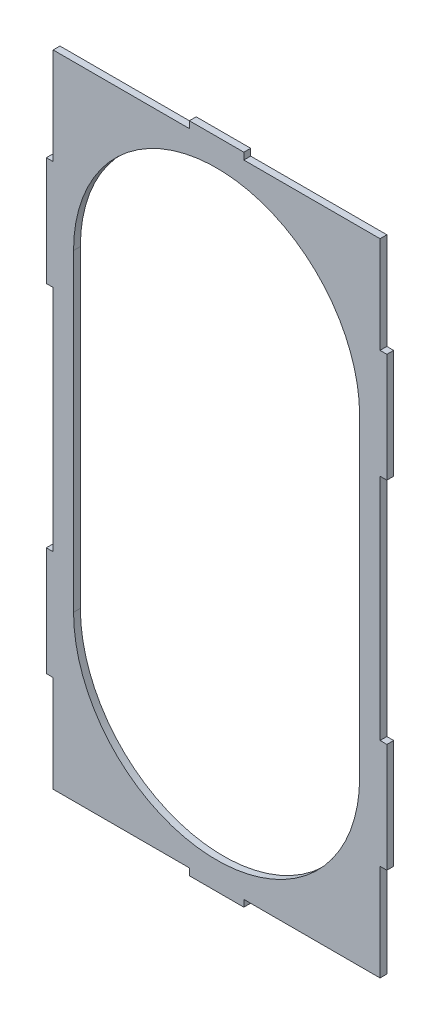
from build123d import *

# Parameters (mm, degrees)
BOSS_EXTRUDE1_DEPTH = 3.175


with BuildPart() as part:
    # Sketch1 → Boss-Extrude1 (new body)
    with BuildSketch(Plane.XY):
        Polygon((19.984980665, 58.303161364), (83.484980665, 58.303161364), (83.484980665, 13.218161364), (86.659980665, 13.218161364), (86.659980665, -37.581838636), (83.484980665, -37.581838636), (83.484980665, -144.261838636), (86.659980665, -144.261838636), (86.659980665, -195.061838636), (83.484980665, -195.061838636), (83.484980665, -240.146838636), (19.984980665, -240.146838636), (19.984980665, -243.321838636), (-5.415019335, -243.321838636), (-5.415019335, -240.146838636), (-68.915019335, -240.146838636), (-68.915019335, -195.061838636), (-72.090019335, -195.061838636), (-72.090019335, -144.261838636), (-68.915019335, -144.261838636), (-68.915019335, -37.581838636), (-72.090019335, -37.581838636), (-72.090019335, 13.218161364), (-68.915019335, 13.218161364), (-68.915019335, 58.303161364), (-5.415019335, 58.303161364), (-5.415019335, 61.478161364), (19.984980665, 61.478161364), align=None)
        with BuildLine():
            Line((-59.390019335, -17.896838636), (-59.390019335, -163.946838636))
            ThreePointArc((-59.390019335, -163.946838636), (7.284980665, -230.621838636), (73.959980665, -163.946838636))
            Line((73.959980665, -163.946838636), (73.959980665, -17.896838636))
            ThreePointArc((73.959980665, -17.896838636), (7.284980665, 48.778161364), (-59.390019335, -17.896838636))
        make_face(mode=Mode.SUBTRACT)
    extrude(amount=BOSS_EXTRUDE1_DEPTH)


solid = part.part
